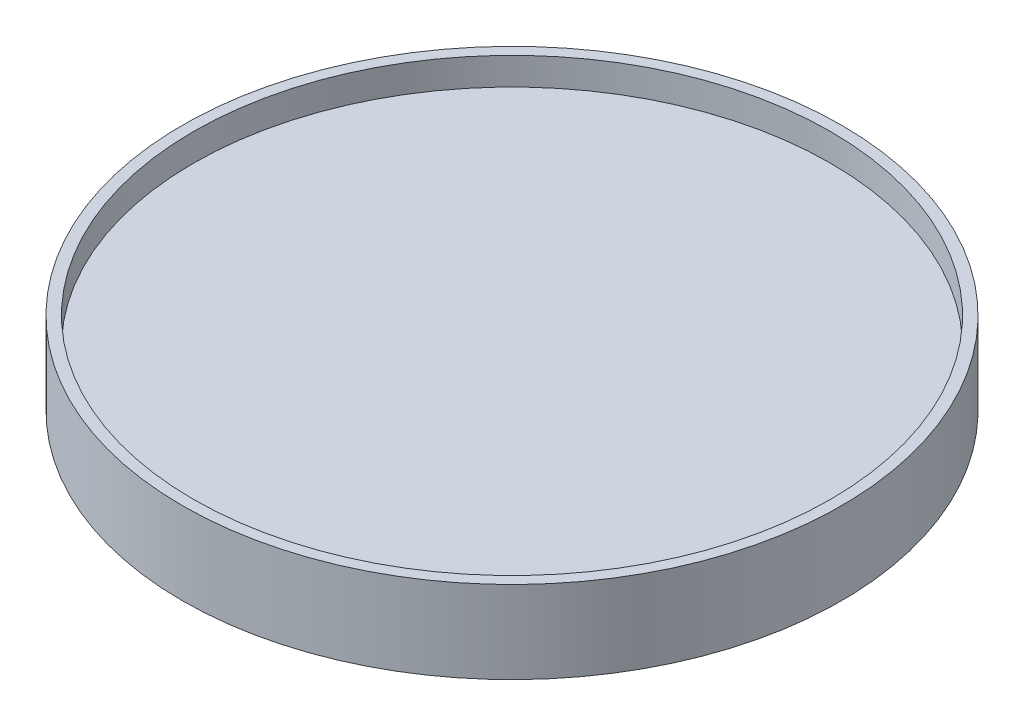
ISO-10303-21;
HEADER;
FILE_DESCRIPTION(('STEP AP214'),'2;1');
FILE_NAME('part.step','',(''),(''),'','','');
FILE_SCHEMA(('AUTOMOTIVE_DESIGN { 1 0 10303 214 1 1 1 1 }'));
ENDSEC;
DATA;
#1=APPLICATION_CONTEXT('core data for automotive mechanical design processes');
#2=APPLICATION_PROTOCOL_DEFINITION('international standard','automotive_design',2000,#1);
#3=PRODUCT_CONTEXT('',#1,'mechanical');
#4=PRODUCT('Part','Part','',(#3));
#5=PRODUCT_RELATED_PRODUCT_CATEGORY('part','',(#4));
#6=PRODUCT_DEFINITION_FORMATION('','',#4);
#7=PRODUCT_DEFINITION_CONTEXT('part definition',#1,'design');
#8=PRODUCT_DEFINITION('design','',#6,#7);
#9=PRODUCT_DEFINITION_SHAPE('','',#8);
#10=(LENGTH_UNIT() NAMED_UNIT(*) SI_UNIT(.MILLI.,.METRE.));
#11=(NAMED_UNIT(*) PLANE_ANGLE_UNIT() SI_UNIT($,.RADIAN.));
#12=(NAMED_UNIT(*) SI_UNIT($,.STERADIAN.) SOLID_ANGLE_UNIT());
#13=UNCERTAINTY_MEASURE_WITH_UNIT(LENGTH_MEASURE(1.E-05),#10,'distance_accuracy_value','');
#14=(GEOMETRIC_REPRESENTATION_CONTEXT(3) GLOBAL_UNCERTAINTY_ASSIGNED_CONTEXT((#13)) GLOBAL_UNIT_ASSIGNED_CONTEXT((#10,
#11,#12)) REPRESENTATION_CONTEXT('',''));
#15=CARTESIAN_POINT('',(0.,0.,0.));
#16=DIRECTION('',(0.,0.,1.));
#17=DIRECTION('',(1.,0.,0.));
#18=AXIS2_PLACEMENT_3D('',#15,#16,#17);
#19=CARTESIAN_POINT('',(0.,12.7,0.));
#20=DIRECTION('',(0.,-1.,0.));
#21=DIRECTION('',(0.,0.,-1.));
#22=AXIS2_PLACEMENT_3D('',#19,#20,#21);
#23=CYLINDRICAL_SURFACE('',#22,76.2);
#24=CARTESIAN_POINT('',(0.,0.,0.));
#25=DIRECTION('',(0.,1.,0.));
#26=DIRECTION('',(0.,0.,1.));
#27=AXIS2_PLACEMENT_3D('',#24,#25,#26);
#28=CIRCLE('',#27,76.2);
#29=CARTESIAN_POINT('',(0.,0.,76.2));
#30=VERTEX_POINT('',#29);
#31=EDGE_CURVE('E37',#30,#30,#28,.T.);
#32=ORIENTED_EDGE('',*,*,#31,.T.);
#33=EDGE_LOOP('',(#32));
#34=FACE_BOUND('',#33,.T.);
#35=CARTESIAN_POINT('',(0.,19.05,0.));
#36=DIRECTION('',(0.,1.,0.));
#37=DIRECTION('',(0.,0.,1.));
#38=AXIS2_PLACEMENT_3D('',#35,#36,#37);
#39=CIRCLE('',#38,76.2);
#40=CARTESIAN_POINT('',(0.,19.05,76.2));
#41=VERTEX_POINT('',#40);
#42=EDGE_CURVE('E41',#41,#41,#39,.T.);
#43=ORIENTED_EDGE('',*,*,#42,.F.);
#44=EDGE_LOOP('',(#43));
#45=FACE_BOUND('',#44,.T.);
#46=ADVANCED_FACE('F31',(#34,#45),#23,.T.);
#47=CARTESIAN_POINT('',(0.,0.,0.));
#48=DIRECTION('',(0.,1.,0.));
#49=DIRECTION('',(0.,0.,1.));
#50=AXIS2_PLACEMENT_3D('',#47,#48,#49);
#51=PLANE('',#50);
#52=ORIENTED_EDGE('',*,*,#31,.F.);
#53=EDGE_LOOP('',(#52));
#54=FACE_BOUND('',#53,.T.);
#55=ADVANCED_FACE('F55',(#54),#51,.F.);
#56=CARTESIAN_POINT('',(0.,19.05,0.));
#57=DIRECTION('',(0.,1.,0.));
#58=DIRECTION('',(0.,0.,1.));
#59=AXIS2_PLACEMENT_3D('',#56,#57,#58);
#60=PLANE('',#59);
#61=ORIENTED_EDGE('',*,*,#42,.T.);
#62=EDGE_LOOP('',(#61));
#63=FACE_BOUND('',#62,.T.);
#64=CARTESIAN_POINT('',(0.,19.05,0.));
#65=DIRECTION('',(0.,1.,0.));
#66=DIRECTION('',(0.,0.,1.));
#67=AXIS2_PLACEMENT_3D('',#64,#65,#66);
#68=CIRCLE('',#67,73.66);
#69=CARTESIAN_POINT('',(0.,19.05,73.66));
#70=VERTEX_POINT('',#69);
#71=EDGE_CURVE('E45',#70,#70,#68,.T.);
#72=ORIENTED_EDGE('',*,*,#71,.F.);
#73=EDGE_LOOP('',(#72));
#74=FACE_BOUND('',#73,.T.);
#75=ADVANCED_FACE('F53',(#63,#74),#60,.T.);
#76=CARTESIAN_POINT('',(0.,19.05,0.));
#77=DIRECTION('',(0.,-1.,0.));
#78=DIRECTION('',(0.,0.,-1.));
#79=AXIS2_PLACEMENT_3D('',#76,#77,#78);
#80=CYLINDRICAL_SURFACE('',#79,73.66);
#81=ORIENTED_EDGE('',*,*,#71,.T.);
#82=EDGE_LOOP('',(#81));
#83=FACE_BOUND('',#82,.T.);
#84=CARTESIAN_POINT('',(0.,12.7,0.));
#85=DIRECTION('',(0.,1.,0.));
#86=DIRECTION('',(0.,0.,1.));
#87=AXIS2_PLACEMENT_3D('',#84,#85,#86);
#88=CIRCLE('',#87,73.66);
#89=CARTESIAN_POINT('',(0.,12.7,73.66));
#90=VERTEX_POINT('',#89);
#91=EDGE_CURVE('E10',#90,#90,#88,.F.);
#92=ORIENTED_EDGE('',*,*,#91,.T.);
#93=EDGE_LOOP('',(#92));
#94=FACE_BOUND('',#93,.T.);
#95=ADVANCED_FACE('F51',(#83,#94),#80,.F.);
#96=CARTESIAN_POINT('',(0.,12.7,0.));
#97=DIRECTION('',(0.,1.,0.));
#98=DIRECTION('',(0.,0.,1.));
#99=AXIS2_PLACEMENT_3D('',#96,#97,#98);
#100=PLANE('',#99);
#101=ORIENTED_EDGE('',*,*,#91,.F.);
#102=EDGE_LOOP('',(#101));
#103=FACE_BOUND('',#102,.T.);
#104=ADVANCED_FACE('F62',(#103),#100,.T.);
#105=CLOSED_SHELL('',(#46,#55,#75,#95,#104));
#106=MANIFOLD_SOLID_BREP('B2',#105);
#107=ADVANCED_BREP_SHAPE_REPRESENTATION('',(#18,#106),#14);
#108=SHAPE_DEFINITION_REPRESENTATION(#9,#107);
ENDSEC;
END-ISO-10303-21;
